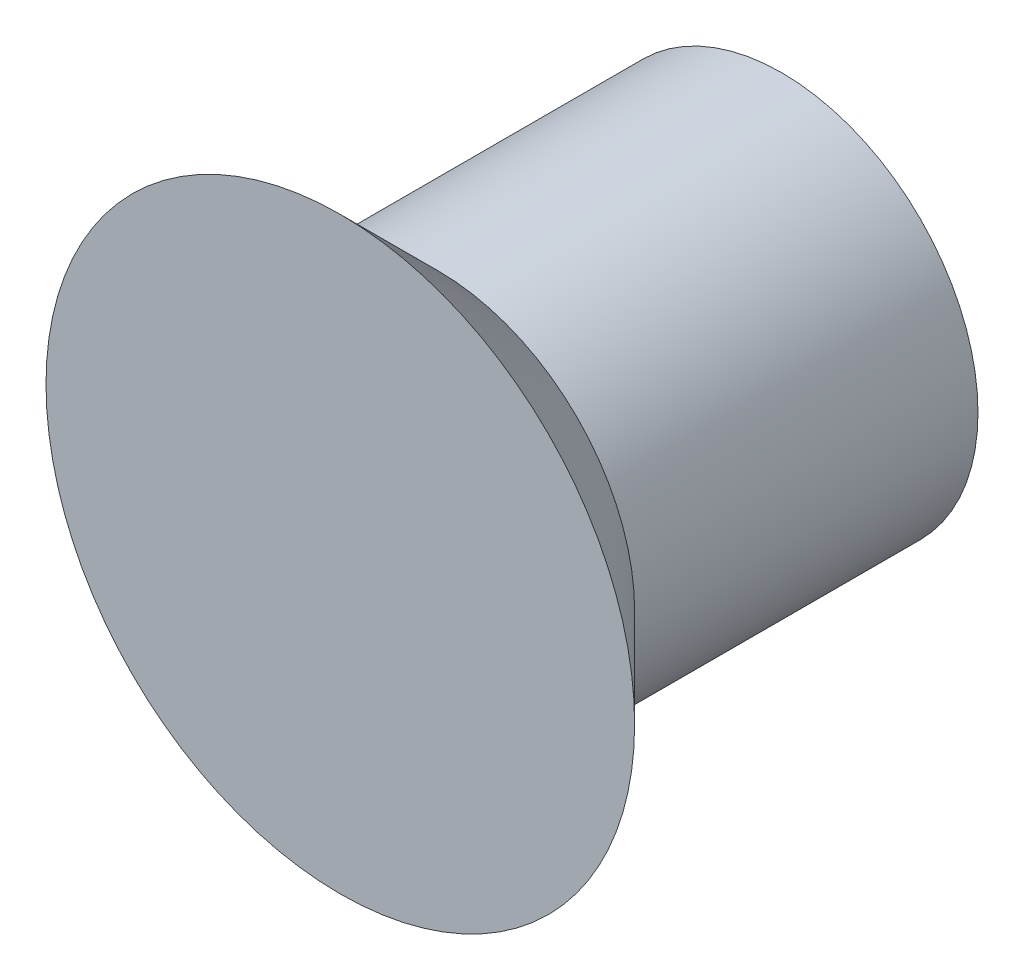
ISO-10303-21;
HEADER;
FILE_DESCRIPTION(('STEP AP214'),'2;1');
FILE_NAME('part.step','',(''),(''),'','','');
FILE_SCHEMA(('AUTOMOTIVE_DESIGN { 1 0 10303 214 1 1 1 1 }'));
ENDSEC;
DATA;
#1=APPLICATION_CONTEXT('core data for automotive mechanical design processes');
#2=APPLICATION_PROTOCOL_DEFINITION('international standard','automotive_design',2000,#1);
#3=PRODUCT_CONTEXT('',#1,'mechanical');
#4=PRODUCT('Part','Part','',(#3));
#5=PRODUCT_RELATED_PRODUCT_CATEGORY('part','',(#4));
#6=PRODUCT_DEFINITION_FORMATION('','',#4);
#7=PRODUCT_DEFINITION_CONTEXT('part definition',#1,'design');
#8=PRODUCT_DEFINITION('design','',#6,#7);
#9=PRODUCT_DEFINITION_SHAPE('','',#8);
#10=(LENGTH_UNIT() NAMED_UNIT(*) SI_UNIT(.MILLI.,.METRE.));
#11=(NAMED_UNIT(*) PLANE_ANGLE_UNIT() SI_UNIT($,.RADIAN.));
#12=(NAMED_UNIT(*) SI_UNIT($,.STERADIAN.) SOLID_ANGLE_UNIT());
#13=UNCERTAINTY_MEASURE_WITH_UNIT(LENGTH_MEASURE(1.E-05),#10,'distance_accuracy_value','');
#14=(GEOMETRIC_REPRESENTATION_CONTEXT(3) GLOBAL_UNCERTAINTY_ASSIGNED_CONTEXT((#13)) GLOBAL_UNIT_ASSIGNED_CONTEXT((#10,
#11,#12)) REPRESENTATION_CONTEXT('',''));
#15=CARTESIAN_POINT('',(0.,0.,0.));
#16=DIRECTION('',(0.,0.,1.));
#17=DIRECTION('',(1.,0.,0.));
#18=AXIS2_PLACEMENT_3D('',#15,#16,#17);
#19=CARTESIAN_POINT('',(0.,0.,3.5));
#20=DIRECTION('',(0.,0.,-1.));
#21=DIRECTION('',(-1.,0.,0.));
#22=AXIS2_PLACEMENT_3D('',#19,#20,#21);
#23=CYLINDRICAL_SURFACE('',#22,2.);
#24=CARTESIAN_POINT('',(0.,0.,3.5));
#25=DIRECTION('',(0.,0.,1.));
#26=DIRECTION('',(1.,0.,0.));
#27=AXIS2_PLACEMENT_3D('',#24,#25,#26);
#28=CIRCLE('',#27,2.);
#29=CARTESIAN_POINT('',(2.,0.,3.5));
#30=VERTEX_POINT('',#29);
#31=EDGE_CURVE('E10',#30,#30,#28,.T.);
#32=ORIENTED_EDGE('',*,*,#31,.F.);
#33=EDGE_LOOP('',(#32));
#34=FACE_BOUND('',#33,.T.);
#35=CARTESIAN_POINT('',(0.,0.,0.));
#36=DIRECTION('',(0.,0.,1.));
#37=DIRECTION('',(1.,0.,0.));
#38=AXIS2_PLACEMENT_3D('',#35,#36,#37);
#39=CIRCLE('',#38,2.);
#40=CARTESIAN_POINT('',(2.,0.,0.));
#41=VERTEX_POINT('',#40);
#42=EDGE_CURVE('E40',#41,#41,#39,.T.);
#43=ORIENTED_EDGE('',*,*,#42,.T.);
#44=EDGE_LOOP('',(#43));
#45=FACE_BOUND('',#44,.T.);
#46=ADVANCED_FACE('F37',(#34,#45),#23,.T.);
#47=CARTESIAN_POINT('',(0.,0.,0.));
#48=DIRECTION('',(0.,0.,1.));
#49=DIRECTION('',(1.,0.,0.));
#50=AXIS2_PLACEMENT_3D('',#47,#48,#49);
#51=PLANE('',#50);
#52=ORIENTED_EDGE('',*,*,#42,.F.);
#53=EDGE_LOOP('',(#52));
#54=FACE_BOUND('',#53,.T.);
#55=ADVANCED_FACE('F59',(#54),#51,.F.);
#56=CARTESIAN_POINT('',(0.,0.,3.5));
#57=DIRECTION('',(0.,0.,1.));
#58=DIRECTION('',(1.,0.,0.));
#59=AXIS2_PLACEMENT_3D('',#56,#57,#58);
#60=CONICAL_SURFACE('',#59,2.,0.78539816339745);
#61=CARTESIAN_POINT('',(0.,0.,4.5));
#62=DIRECTION('',(0.,0.,1.));
#63=DIRECTION('',(1.,0.,0.));
#64=AXIS2_PLACEMENT_3D('',#61,#62,#63);
#65=CIRCLE('',#64,3.);
#66=CARTESIAN_POINT('',(3.,0.,4.5));
#67=VERTEX_POINT('',#66);
#68=EDGE_CURVE('E49',#67,#67,#65,.T.);
#69=ORIENTED_EDGE('',*,*,#68,.F.);
#70=EDGE_LOOP('',(#69));
#71=FACE_BOUND('',#70,.T.);
#72=ORIENTED_EDGE('',*,*,#31,.T.);
#73=EDGE_LOOP('',(#72));
#74=FACE_BOUND('',#73,.T.);
#75=ADVANCED_FACE('F57',(#71,#74),#60,.T.);
#76=CARTESIAN_POINT('',(0.,0.,4.5));
#77=DIRECTION('',(0.,0.,1.));
#78=DIRECTION('',(1.,0.,0.));
#79=AXIS2_PLACEMENT_3D('',#76,#77,#78);
#80=PLANE('',#79);
#81=ORIENTED_EDGE('',*,*,#68,.T.);
#82=EDGE_LOOP('',(#81));
#83=FACE_BOUND('',#82,.T.);
#84=ADVANCED_FACE('F55',(#83),#80,.T.);
#85=CLOSED_SHELL('',(#46,#55,#75,#84));
#86=MANIFOLD_SOLID_BREP('B2',#85);
#87=ADVANCED_BREP_SHAPE_REPRESENTATION('',(#18,#86),#14);
#88=SHAPE_DEFINITION_REPRESENTATION(#9,#87);
ENDSEC;
END-ISO-10303-21;
